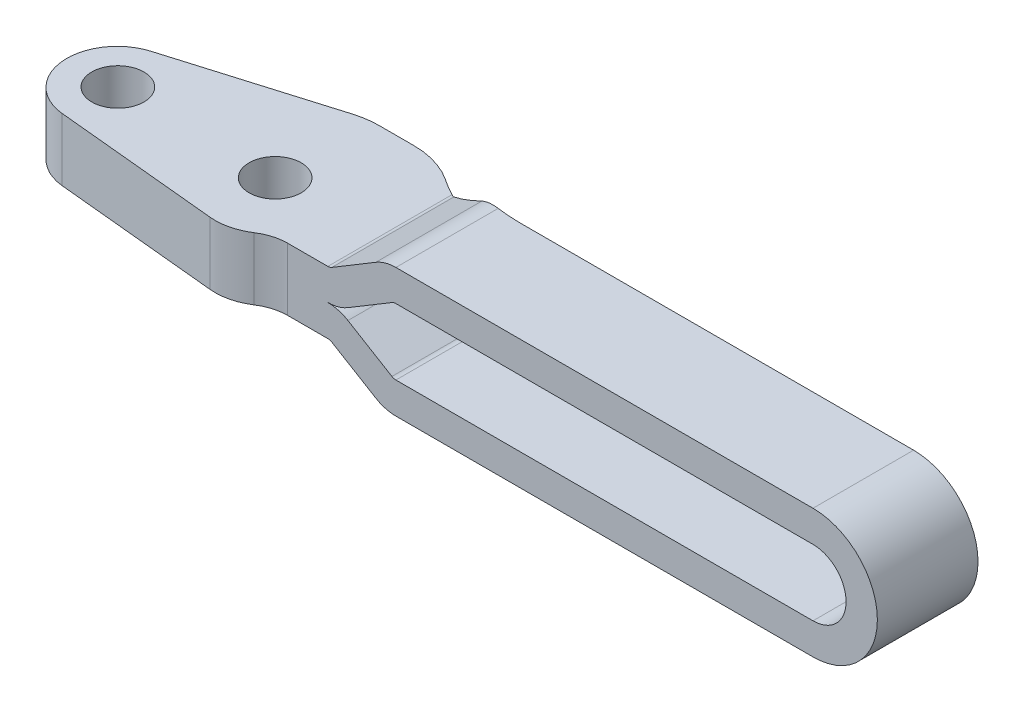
ISO-10303-21;
HEADER;
FILE_DESCRIPTION(('STEP AP214'),'2;1');
FILE_NAME('part.step','',(''),(''),'','','');
FILE_SCHEMA(('AUTOMOTIVE_DESIGN { 1 0 10303 214 1 1 1 1 }'));
ENDSEC;
DATA;
#1=APPLICATION_CONTEXT('core data for automotive mechanical design processes');
#2=APPLICATION_PROTOCOL_DEFINITION('international standard','automotive_design',2000,#1);
#3=PRODUCT_CONTEXT('',#1,'mechanical');
#4=PRODUCT('Part','Part','',(#3));
#5=PRODUCT_RELATED_PRODUCT_CATEGORY('part','',(#4));
#6=PRODUCT_DEFINITION_FORMATION('','',#4);
#7=PRODUCT_DEFINITION_CONTEXT('part definition',#1,'design');
#8=PRODUCT_DEFINITION('design','',#6,#7);
#9=PRODUCT_DEFINITION_SHAPE('','',#8);
#10=(LENGTH_UNIT() NAMED_UNIT(*) SI_UNIT(.MILLI.,.METRE.));
#11=(NAMED_UNIT(*) PLANE_ANGLE_UNIT() SI_UNIT($,.RADIAN.));
#12=(NAMED_UNIT(*) SI_UNIT($,.STERADIAN.) SOLID_ANGLE_UNIT());
#13=UNCERTAINTY_MEASURE_WITH_UNIT(LENGTH_MEASURE(1.E-05),#10,'distance_accuracy_value','');
#14=(GEOMETRIC_REPRESENTATION_CONTEXT(3) GLOBAL_UNCERTAINTY_ASSIGNED_CONTEXT((#13)) GLOBAL_UNIT_ASSIGNED_CONTEXT((#10,
#11,#12)) REPRESENTATION_CONTEXT('',''));
#15=CARTESIAN_POINT('',(0.,0.,0.));
#16=DIRECTION('',(0.,0.,1.));
#17=DIRECTION('',(1.,0.,0.));
#18=AXIS2_PLACEMENT_3D('',#15,#16,#17);
#19=CARTESIAN_POINT('',(31.498978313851,-3.17500000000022,-15.1675));
#20=DIRECTION('',(0.,-1.,0.));
#21=DIRECTION('',(1.,0.,0.));
#22=AXIS2_PLACEMENT_3D('',#19,#20,#21);
#23=PLANE('',#22);
#24=DIRECTION('',(-1.,0.,0.));
#25=VECTOR('',#24,1.);
#26=CARTESIAN_POINT('',(31.498978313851,-3.17500000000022,4.8325));
#27=LINE('',#26,#25);
#28=CARTESIAN_POINT('',(71.5031516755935,-3.17500000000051,4.8325));
#29=VERTEX_POINT('',#28);
#30=CARTESIAN_POINT('',(31.498978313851,-3.17500000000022,4.8325));
#31=VERTEX_POINT('',#30);
#32=EDGE_CURVE('E509',#29,#31,#27,.T.);
#33=ORIENTED_EDGE('',*,*,#32,.F.);
#34=DIRECTION('',(0.,0.,1.));
#35=VECTOR('',#34,1.);
#36=CARTESIAN_POINT('',(71.5031516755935,-3.17500000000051,-15.1675));
#37=LINE('',#36,#35);
#38=CARTESIAN_POINT('',(71.5031516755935,-3.17500000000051,-4.81950000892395));
#39=VERTEX_POINT('',#38);
#40=EDGE_CURVE('E476',#39,#29,#37,.T.);
#41=ORIENTED_EDGE('',*,*,#40,.F.);
#42=DIRECTION('',(1.,0.,0.));
#43=VECTOR('',#42,1.);
#44=CARTESIAN_POINT('',(31.498978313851,-3.17500000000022,-4.81950000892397));
#45=LINE('',#44,#43);
#46=CARTESIAN_POINT('',(33.9646617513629,-3.17500000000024,-4.81950000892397));
#47=VERTEX_POINT('',#46);
#48=EDGE_CURVE('E484',#47,#39,#45,.T.);
#49=ORIENTED_EDGE('',*,*,#48,.F.);
#50=CARTESIAN_POINT('',(33.9646617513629,-3.17500000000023,-23.8694999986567));
#51=DIRECTION('',(0.,-1.,0.));
#52=DIRECTION('',(1.,0.,0.));
#53=AXIS2_PLACEMENT_3D('',#50,#51,#52);
#54=CIRCLE('',#53,19.0499999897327);
#55=CARTESIAN_POINT('',(31.498978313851,-3.17500000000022,-4.97974338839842));
#56=VERTEX_POINT('',#55);
#57=EDGE_CURVE('E223',#56,#47,#54,.F.);
#58=ORIENTED_EDGE('',*,*,#57,.F.);
#59=DIRECTION('',(0.,0.,1.));
#60=VECTOR('',#59,1.);
#61=CARTESIAN_POINT('',(31.498978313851,-3.17500000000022,-15.1675));
#62=LINE('',#61,#60);
#63=EDGE_CURVE('E453',#56,#31,#62,.T.);
#64=ORIENTED_EDGE('',*,*,#63,.T.);
#65=EDGE_LOOP('',(#33,#41,#49,#58,#64));
#66=FACE_BOUND('',#65,.T.);
#67=ADVANCED_FACE('F14',(#66),#23,.F.);
#68=CARTESIAN_POINT('',(71.5031516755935,-5.10008701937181E-13,-15.1675));
#69=DIRECTION('',(0.,0.,1.));
#70=DIRECTION('',(1.,0.,0.));
#71=AXIS2_PLACEMENT_3D('',#68,#69,#70);
#72=CYLINDRICAL_SURFACE('',#71,3.175);
#73=CARTESIAN_POINT('',(71.5031516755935,-5.10008701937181E-13,4.8325));
#74=DIRECTION('',(0.,0.,1.));
#75=DIRECTION('',(1.,0.,0.));
#76=AXIS2_PLACEMENT_3D('',#73,#74,#75);
#77=CIRCLE('',#76,3.175);
#78=CARTESIAN_POINT('',(71.5031516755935,3.17499999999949,4.8325));
#79=VERTEX_POINT('',#78);
#80=EDGE_CURVE('E382',#79,#29,#77,.F.);
#81=ORIENTED_EDGE('',*,*,#80,.F.);
#82=DIRECTION('',(0.,0.,1.));
#83=VECTOR('',#82,1.);
#84=CARTESIAN_POINT('',(71.5031516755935,3.17499999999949,-15.1675));
#85=LINE('',#84,#83);
#86=CARTESIAN_POINT('',(71.5031516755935,3.17499999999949,-4.81950000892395));
#87=VERTEX_POINT('',#86);
#88=EDGE_CURVE('E473',#87,#79,#85,.T.);
#89=ORIENTED_EDGE('',*,*,#88,.F.);
#90=CARTESIAN_POINT('',(71.5031516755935,-5.10008701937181E-13,-4.81950000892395));
#91=DIRECTION('',(0.,0.,-1.));
#92=DIRECTION('',(-1.,0.,0.));
#93=AXIS2_PLACEMENT_3D('',#90,#91,#92);
#94=CIRCLE('',#93,3.175);
#95=EDGE_CURVE('E544',#39,#87,#94,.F.);
#96=ORIENTED_EDGE('',*,*,#95,.F.);
#97=ORIENTED_EDGE('',*,*,#40,.T.);
#98=EDGE_LOOP('',(#81,#89,#96,#97));
#99=FACE_BOUND('',#98,.T.);
#100=ADVANCED_FACE('F348',(#99),#72,.F.);
#101=CARTESIAN_POINT('',(71.5031516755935,3.17499999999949,-15.1675));
#102=DIRECTION('',(0.,1.,0.));
#103=DIRECTION('',(0.,0.,1.));
#104=AXIS2_PLACEMENT_3D('',#101,#102,#103);
#105=PLANE('',#104);
#106=DIRECTION('',(1.,0.,0.));
#107=VECTOR('',#106,1.);
#108=CARTESIAN_POINT('',(71.5031516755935,3.17499999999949,4.8325));
#109=LINE('',#108,#107);
#110=CARTESIAN_POINT('',(31.4989783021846,3.17499999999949,4.8325));
#111=VERTEX_POINT('',#110);
#112=EDGE_CURVE('E384',#111,#79,#109,.T.);
#113=ORIENTED_EDGE('',*,*,#112,.F.);
#114=DIRECTION('',(0.,0.,1.));
#115=VECTOR('',#114,1.);
#116=CARTESIAN_POINT('',(31.4989783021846,3.17499999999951,-15.1675));
#117=LINE('',#116,#115);
#118=CARTESIAN_POINT('',(31.4989783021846,3.17499999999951,-4.97974338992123));
#119=VERTEX_POINT('',#118);
#120=EDGE_CURVE('E470',#119,#111,#117,.T.);
#121=ORIENTED_EDGE('',*,*,#120,.F.);
#122=CARTESIAN_POINT('',(33.9646617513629,3.17499999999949,-23.8694999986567));
#123=DIRECTION('',(0.,1.,0.));
#124=DIRECTION('',(0.,0.,1.));
#125=AXIS2_PLACEMENT_3D('',#122,#123,#124);
#126=CIRCLE('',#125,19.0499999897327);
#127=CARTESIAN_POINT('',(33.9646617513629,3.17499999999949,-4.81950000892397));
#128=VERTEX_POINT('',#127);
#129=EDGE_CURVE('E580',#128,#119,#126,.F.);
#130=ORIENTED_EDGE('',*,*,#129,.F.);
#131=DIRECTION('',(-1.,0.,0.));
#132=VECTOR('',#131,1.);
#133=CARTESIAN_POINT('',(71.5031516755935,3.17499999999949,-4.81950000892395));
#134=LINE('',#133,#132);
#135=EDGE_CURVE('E217',#87,#128,#134,.T.);
#136=ORIENTED_EDGE('',*,*,#135,.F.);
#137=ORIENTED_EDGE('',*,*,#88,.T.);
#138=EDGE_LOOP('',(#113,#121,#130,#136,#137));
#139=FACE_BOUND('',#138,.T.);
#140=ADVANCED_FACE('F355',(#139),#105,.F.);
#141=CARTESIAN_POINT('',(31.4989783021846,2.43499999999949,-15.1675));
#142=DIRECTION('',(0.,0.,1.));
#143=DIRECTION('',(1.,0.,0.));
#144=AXIS2_PLACEMENT_3D('',#141,#142,#143);
#145=CYLINDRICAL_SURFACE('',#144,0.740000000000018);
#146=CARTESIAN_POINT('',(31.4989783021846,2.43499999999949,4.8325));
#147=DIRECTION('',(0.,0.,1.));
#148=DIRECTION('',(1.,0.,0.));
#149=AXIS2_PLACEMENT_3D('',#146,#147,#148);
#150=CIRCLE('',#149,0.740000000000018);
#151=CARTESIAN_POINT('',(31.1178501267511,3.06930380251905,4.8325));
#152=VERTEX_POINT('',#151);
#153=EDGE_CURVE('E386',#152,#111,#150,.F.);
#154=ORIENTED_EDGE('',*,*,#153,.F.);
#155=DIRECTION('',(0.,0.,1.));
#156=VECTOR('',#155,1.);
#157=CARTESIAN_POINT('',(31.1178501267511,3.06930380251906,-15.1675));
#158=LINE('',#157,#156);
#159=CARTESIAN_POINT('',(31.1178501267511,3.06930380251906,-5.03341327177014));
#160=VERTEX_POINT('',#159);
#161=EDGE_CURVE('E467',#160,#152,#158,.T.);
#162=ORIENTED_EDGE('',*,*,#161,.F.);
#163=CARTESIAN_POINT('',(31.4989783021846,3.17499999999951,-4.97974338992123));
#164=CARTESIAN_POINT('',(31.4565310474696,3.17504192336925,-4.985278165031));
#165=CARTESIAN_POINT('',(31.4140902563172,3.17135035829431,-4.99096923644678));
#166=CARTESIAN_POINT('',(31.3313936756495,3.15695659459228,-5.00233154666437));
#167=CARTESIAN_POINT('',(31.2911103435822,3.14641073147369,-5.00800045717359));
#168=CARTESIAN_POINT('',(31.2288267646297,3.12436674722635,-5.01695996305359));
#169=CARTESIAN_POINT('',(31.2060559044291,3.1150016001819,-5.02027983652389));
#170=CARTESIAN_POINT('',(31.1612525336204,3.09390951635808,-5.02689098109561));
#171=CARTESIAN_POINT('',(31.1392339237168,3.0821527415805,-5.03018127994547));
#172=CARTESIAN_POINT('',(31.1178501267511,3.06930380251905,-5.03341327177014));
#173=B_SPLINE_CURVE_WITH_KNOTS('',3,(#163,#164,#165,#166,#167,#168,#169,#170,#171,#172),
.UNSPECIFIED.,.F.,.F.,(4,2,2,2,4),(0.,0.128294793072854,0.253761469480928,0.32818303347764,
0.403597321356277),.UNSPECIFIED.);
#174=EDGE_CURVE('E301',#119,#160,#173,.T.);
#175=ORIENTED_EDGE('',*,*,#174,.F.);
#176=ORIENTED_EDGE('',*,*,#120,.T.);
#177=EDGE_LOOP('',(#154,#162,#175,#176));
#178=FACE_BOUND('',#177,.T.);
#179=ADVANCED_FACE('F643',(#178),#145,.F.);
#180=CARTESIAN_POINT('',(31.1178501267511,3.06930380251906,-15.1675));
#181=DIRECTION('',(-0.515038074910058,0.85716730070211,0.));
#182=DIRECTION('',(-0.85716730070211,-0.515038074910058,0.));
#183=AXIS2_PLACEMENT_3D('',#180,#181,#182);
#184=PLANE('',#183);
#185=DIRECTION('',(0.85716730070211,0.515038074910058,0.));
#186=VECTOR('',#185,1.);
#187=CARTESIAN_POINT('',(31.1178501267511,3.06930380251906,4.8325));
#188=LINE('',#187,#186);
#189=CARTESIAN_POINT('',(26.8987193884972,0.534194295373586,4.8325));
#190=VERTEX_POINT('',#189);
#191=EDGE_CURVE('E388',#190,#152,#188,.T.);
#192=ORIENTED_EDGE('',*,*,#191,.F.);
#193=DIRECTION('',(0.,0.,1.));
#194=VECTOR('',#193,1.);
#195=CARTESIAN_POINT('',(26.8987193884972,0.534194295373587,-15.1675));
#196=LINE('',#195,#194);
#197=CARTESIAN_POINT('',(26.8987193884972,0.534194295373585,-6.17840172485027));
#198=VERTEX_POINT('',#197);
#199=EDGE_CURVE('E464',#198,#190,#196,.T.);
#200=ORIENTED_EDGE('',*,*,#199,.F.);
#201=CARTESIAN_POINT('',(33.9646617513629,4.77984079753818,-23.8694999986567));
#202=DIRECTION('',(-0.515038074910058,0.85716730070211,0.));
#203=DIRECTION('',(0.85716730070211,0.515038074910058,0.));
#204=AXIS2_PLACEMENT_3D('',#201,#202,#203);
#205=ELLIPSE('',#204,22.224366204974,19.0499999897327);
#206=EDGE_CURVE('E577',#160,#198,#205,.F.);
#207=ORIENTED_EDGE('',*,*,#206,.F.);
#208=ORIENTED_EDGE('',*,*,#161,.T.);
#209=EDGE_LOOP('',(#192,#200,#207,#208));
#210=FACE_BOUND('',#209,.T.);
#211=ADVANCED_FACE('F639',(#210),#184,.F.);
#212=CARTESIAN_POINT('',(24.9724769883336,3.73999999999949,-15.1675));
#213=DIRECTION('',(0.,0.,1.));
#214=DIRECTION('',(1.,0.,0.));
#215=AXIS2_PLACEMENT_3D('',#212,#213,#214);
#216=CYLINDRICAL_SURFACE('',#215,3.74);
#217=CARTESIAN_POINT('',(24.9724769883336,3.73999999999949,4.8325));
#218=DIRECTION('',(0.,0.,1.));
#219=DIRECTION('',(1.,0.,0.));
#220=AXIS2_PLACEMENT_3D('',#217,#218,#219);
#221=CIRCLE('',#220,3.74);
#222=CARTESIAN_POINT('',(24.9724769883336,-5.09575021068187E-13,4.8325));
#223=VERTEX_POINT('',#222);
#224=EDGE_CURVE('E390',#223,#190,#221,.T.);
#225=ORIENTED_EDGE('',*,*,#224,.F.);
#226=DIRECTION('',(0.,0.,1.));
#227=VECTOR('',#226,1.);
#228=CARTESIAN_POINT('',(24.9724769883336,-3.1788807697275E-13,-15.1675));
#229=LINE('',#228,#227);
#230=CARTESIAN_POINT('',(24.9724769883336,-3.1788807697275E-13,-7.07536075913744));
#231=VERTEX_POINT('',#230);
#232=EDGE_CURVE('E461',#231,#223,#229,.T.);
#233=ORIENTED_EDGE('',*,*,#232,.F.);
#234=CARTESIAN_POINT('',(26.8987193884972,0.534194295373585,-6.17840172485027));
#235=CARTESIAN_POINT('',(26.8015997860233,0.475820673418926,-6.2171807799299));
#236=CARTESIAN_POINT('',(26.7023646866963,0.422218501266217,-6.25775374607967));
#237=CARTESIAN_POINT('',(26.5006929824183,0.324642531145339,-6.34227795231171));
#238=CARTESIAN_POINT('',(26.3982574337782,0.280665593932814,-6.38622808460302));
#239=CARTESIAN_POINT('',(26.1932963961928,0.203198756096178,-6.47637840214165));
#240=CARTESIAN_POINT('',(26.0908167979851,0.169510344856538,-6.52251305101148));
#241=CARTESIAN_POINT('',(25.8845972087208,0.111348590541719,-6.61760300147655));
#242=CARTESIAN_POINT('',(25.7808574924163,0.0868732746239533,-6.66655769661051));
#243=CARTESIAN_POINT('',(25.5601194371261,0.0445426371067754,-6.77321566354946));
#244=CARTESIAN_POINT('',(25.443057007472,0.0278690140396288,-6.83125511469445));
#245=CARTESIAN_POINT('',(25.207915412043,0.00552501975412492,-6.95088123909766));
#246=CARTESIAN_POINT('',(25.089840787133,-1.16478236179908E-05,-7.01250198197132));
#247=CARTESIAN_POINT('',(24.9724769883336,-8.14785318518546E-13,-7.07536075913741));
#248=B_SPLINE_CURVE_WITH_KNOTS('',3,(#234,#235,#236,#237,#238,#239,#240,#241,#242,#243,#244,
#245,#246,#247),.UNSPECIFIED.,.F.,.F.,(4,2,2,2,2,2,4),(0.,0.359125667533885,0.718134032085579,
1.06969962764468,1.42118989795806,1.81583425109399,2.21518884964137),.UNSPECIFIED.);
#249=EDGE_CURVE('E292',#198,#231,#248,.T.);
#250=ORIENTED_EDGE('',*,*,#249,.F.);
#251=ORIENTED_EDGE('',*,*,#199,.T.);
#252=EDGE_LOOP('',(#225,#233,#250,#251));
#253=FACE_BOUND('',#252,.T.);
#254=ADVANCED_FACE('F636',(#253),#216,.T.);
#255=CARTESIAN_POINT('',(24.972477,-3.74000000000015,-15.1675));
#256=DIRECTION('',(0.,0.,1.));
#257=DIRECTION('',(1.,0.,0.));
#258=AXIS2_PLACEMENT_3D('',#255,#256,#257);
#259=CYLINDRICAL_SURFACE('',#258,3.73999999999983);
#260=CARTESIAN_POINT('',(24.972477,-3.74000000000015,4.8325));
#261=DIRECTION('',(0.,0.,1.));
#262=DIRECTION('',(1.,0.,0.));
#263=AXIS2_PLACEMENT_3D('',#260,#261,#262);
#264=CIRCLE('',#263,3.73999999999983);
#265=CARTESIAN_POINT('',(26.8987194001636,-0.534194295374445,4.8325));
#266=VERTEX_POINT('',#265);
#267=EDGE_CURVE('E392',#266,#223,#264,.T.);
#268=ORIENTED_EDGE('',*,*,#267,.F.);
#269=DIRECTION('',(0.,0.,1.));
#270=VECTOR('',#269,1.);
#271=CARTESIAN_POINT('',(26.8987194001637,-0.53419429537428,-15.1675));
#272=LINE('',#271,#270);
#273=CARTESIAN_POINT('',(26.8987194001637,-0.53419429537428,-6.17840172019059));
#274=VERTEX_POINT('',#273);
#275=EDGE_CURVE('E458',#274,#266,#272,.T.);
#276=ORIENTED_EDGE('',*,*,#275,.F.);
#277=CARTESIAN_POINT('',(24.9724769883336,-3.1788807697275E-13,-7.07536075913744));
#278=CARTESIAN_POINT('',(25.0803589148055,7.23943557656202E-06,-7.01758431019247));
#279=CARTESIAN_POINT('',(25.1888312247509,-0.00466833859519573,-6.96085422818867));
#280=CARTESIAN_POINT('',(25.4062727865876,-0.0236402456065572,-6.84976778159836));
#281=CARTESIAN_POINT('',(25.5152424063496,-0.0379455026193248,-6.79541366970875));
#282=CARTESIAN_POINT('',(25.7303833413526,-0.0760067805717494,-6.69064143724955));
#283=CARTESIAN_POINT('',(25.8365631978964,-0.0995465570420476,-6.64016281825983));
#284=CARTESIAN_POINT('',(26.0476416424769,-0.156209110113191,-6.54215670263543));
#285=CARTESIAN_POINT('',(26.1525409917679,-0.189325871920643,-6.49462737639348));
#286=CARTESIAN_POINT('',(26.3659655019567,-0.267337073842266,-6.40019444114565));
#287=CARTESIAN_POINT('',(26.4743704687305,-0.312781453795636,-6.35347071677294));
#288=CARTESIAN_POINT('',(26.6889214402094,-0.414981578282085,-6.26325266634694));
#289=CARTESIAN_POINT('',(26.7950253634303,-0.471865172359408,-6.21980325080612));
#290=CARTESIAN_POINT('',(26.8987194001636,-0.534194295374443,-6.17840172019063));
#291=B_SPLINE_CURVE_WITH_KNOTS('',3,(#277,#278,#279,#280,#281,#282,#283,#284,#285,#286,#287,
#288,#289,#290),.UNSPECIFIED.,.F.,.F.,(4,2,2,2,2,2,4),(0.,0.367082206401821,0.73450521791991,
1.09379376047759,1.45285714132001,1.83177266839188,2.21518542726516),.UNSPECIFIED.);
#292=EDGE_CURVE('E284',#231,#274,#291,.T.);
#293=ORIENTED_EDGE('',*,*,#292,.F.);
#294=ORIENTED_EDGE('',*,*,#232,.T.);
#295=EDGE_LOOP('',(#268,#276,#293,#294));
#296=FACE_BOUND('',#295,.T.);
#297=ADVANCED_FACE('F631',(#296),#259,.T.);
#298=CARTESIAN_POINT('',(26.8987194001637,-0.53419429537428,-15.1675));
#299=DIRECTION('',(-0.515038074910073,-0.857167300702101,0.));
#300=DIRECTION('',(0.857167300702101,-0.515038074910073,0.));
#301=AXIS2_PLACEMENT_3D('',#298,#299,#300);
#302=PLANE('',#301);
#303=DIRECTION('',(-0.857167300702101,0.515038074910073,0.));
#304=VECTOR('',#303,1.);
#305=CARTESIAN_POINT('',(26.8987194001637,-0.53419429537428,4.8325));
#306=LINE('',#305,#304);
#307=CARTESIAN_POINT('',(31.1178501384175,-3.06930380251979,4.8325));
#308=VERTEX_POINT('',#307);
#309=EDGE_CURVE('E394',#308,#266,#306,.T.);
#310=ORIENTED_EDGE('',*,*,#309,.F.);
#311=DIRECTION('',(0.,0.,1.));
#312=VECTOR('',#311,1.);
#313=CARTESIAN_POINT('',(31.1178501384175,-3.06930380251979,-15.1675));
#314=LINE('',#313,#312);
#315=CARTESIAN_POINT('',(31.1178501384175,-3.0693038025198,-5.03341327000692));
#316=VERTEX_POINT('',#315);
#317=EDGE_CURVE('E454',#316,#308,#314,.T.);
#318=ORIENTED_EDGE('',*,*,#317,.F.);
#319=CARTESIAN_POINT('',(33.9646617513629,-4.7798407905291,-23.8694999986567));
#320=DIRECTION('',(-0.515038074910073,-0.857167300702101,0.));
#321=DIRECTION('',(-0.857167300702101,0.515038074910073,0.));
#322=AXIS2_PLACEMENT_3D('',#319,#320,#321);
#323=ELLIPSE('',#322,22.2243662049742,19.0499999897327);
#324=EDGE_CURVE('E573',#274,#316,#323,.F.);
#325=ORIENTED_EDGE('',*,*,#324,.F.);
#326=ORIENTED_EDGE('',*,*,#275,.T.);
#327=EDGE_LOOP('',(#310,#318,#325,#326));
#328=FACE_BOUND('',#327,.T.);
#329=ADVANCED_FACE('F364',(#328),#302,.F.);
#330=CARTESIAN_POINT('',(31.4989783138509,-2.43500000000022,-15.1675));
#331=DIRECTION('',(0.,0.,1.));
#332=DIRECTION('',(1.,0.,0.));
#333=AXIS2_PLACEMENT_3D('',#330,#331,#332);
#334=CYLINDRICAL_SURFACE('',#333,0.74);
#335=CARTESIAN_POINT('',(31.4989783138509,-2.43500000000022,4.8325));
#336=DIRECTION('',(0.,0.,1.));
#337=DIRECTION('',(1.,0.,0.));
#338=AXIS2_PLACEMENT_3D('',#335,#336,#337);
#339=CIRCLE('',#338,0.74);
#340=EDGE_CURVE('E396',#31,#308,#339,.F.);
#341=ORIENTED_EDGE('',*,*,#340,.F.);
#342=ORIENTED_EDGE('',*,*,#63,.F.);
#343=CARTESIAN_POINT('',(31.1178501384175,-3.0693038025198,-5.03341327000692));
#344=CARTESIAN_POINT('',(31.1542167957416,-3.09120372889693,-5.02791197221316));
#345=CARTESIAN_POINT('',(31.1924990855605,-3.10989872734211,-5.02223852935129));
#346=CARTESIAN_POINT('',(31.2707992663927,-3.1401527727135,-5.01089228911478));
#347=CARTESIAN_POINT('',(31.3107602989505,-3.15186003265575,-5.00522223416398));
#348=CARTESIAN_POINT('',(31.3755004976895,-3.16504215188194,-4.99625586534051));
#349=CARTESIAN_POINT('',(31.3998419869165,-3.16874218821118,-4.99293231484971));
#350=CARTESIAN_POINT('',(31.4491070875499,-3.17373763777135,-4.98630345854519));
#351=CARTESIAN_POINT('',(31.4740341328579,-3.17500031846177,-4.98299898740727));
#352=CARTESIAN_POINT('',(31.498978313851,-3.17500000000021,-4.97974338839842));
#353=B_SPLINE_CURVE_WITH_KNOTS('',3,(#343,#344,#345,#346,#347,#348,#349,#350,#351,#352),
.UNSPECIFIED.,.F.,.F.,(4,2,2,2,4),(0.,0.128294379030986,0.253760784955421,0.328182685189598,
0.403597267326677),.UNSPECIFIED.);
#354=EDGE_CURVE('E273',#316,#56,#353,.T.);
#355=ORIENTED_EDGE('',*,*,#354,.F.);
#356=ORIENTED_EDGE('',*,*,#317,.T.);
#357=EDGE_LOOP('',(#341,#342,#355,#356));
#358=FACE_BOUND('',#357,.T.);
#359=ADVANCED_FACE('F360',(#358),#334,.F.);
#360=CARTESIAN_POINT('',(77.6781516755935,-12.5,4.8325));
#361=DIRECTION('',(0.,0.,1.));
#362=DIRECTION('',(1.,0.,0.));
#363=AXIS2_PLACEMENT_3D('',#360,#361,#362);
#364=PLANE('',#363);
#365=DIRECTION('',(0.,1.,0.));
#366=VECTOR('',#365,1.);
#367=CARTESIAN_POINT('',(21.1267910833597,-12.5,4.8325));
#368=LINE('',#367,#366);
#369=CARTESIAN_POINT('',(21.1267910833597,-3.00000000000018,4.8325));
#370=VERTEX_POINT('',#369);
#371=CARTESIAN_POINT('',(21.1267910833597,2.99999999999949,4.8325));
#372=VERTEX_POINT('',#371);
#373=EDGE_CURVE('E542',#370,#372,#368,.T.);
#374=ORIENTED_EDGE('',*,*,#373,.F.);
#375=DIRECTION('',(-1.,0.,0.));
#376=VECTOR('',#375,1.);
#377=CARTESIAN_POINT('',(-5.17065825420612,-3.,4.8325));
#378=LINE('',#377,#376);
#379=CARTESIAN_POINT('',(24.972477,-3.00000000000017,4.8325));
#380=VERTEX_POINT('',#379);
#381=EDGE_CURVE('E398',#380,#370,#378,.T.);
#382=ORIENTED_EDGE('',*,*,#381,.F.);
#383=CARTESIAN_POINT('',(24.972477,-3.74000000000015,4.8325));
#384=DIRECTION('',(0.,0.,1.));
#385=DIRECTION('',(1.,0.,0.));
#386=AXIS2_PLACEMENT_3D('',#383,#384,#385);
#387=CIRCLE('',#386,0.74);
#388=CARTESIAN_POINT('',(25.3536051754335,-3.10569619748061,4.8325));
#389=VERTEX_POINT('',#388);
#390=EDGE_CURVE('E401',#389,#380,#387,.T.);
#391=ORIENTED_EDGE('',*,*,#390,.F.);
#392=DIRECTION('',(-0.857167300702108,0.515038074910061,0.));
#393=VECTOR('',#392,1.);
#394=CARTESIAN_POINT('',(25.3536051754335,-3.1056961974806,4.8325));
#395=LINE('',#394,#393);
#396=CARTESIAN_POINT('',(29.5727359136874,-5.64080570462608,4.8325));
#397=VERTEX_POINT('',#396);
#398=EDGE_CURVE('E404',#397,#389,#395,.T.);
#399=ORIENTED_EDGE('',*,*,#398,.F.);
#400=CARTESIAN_POINT('',(31.4989783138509,-2.43500000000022,4.8325));
#401=DIRECTION('',(0.,0.,1.));
#402=DIRECTION('',(1.,0.,0.));
#403=AXIS2_PLACEMENT_3D('',#400,#401,#402);
#404=CIRCLE('',#403,3.73999999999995);
#405=CARTESIAN_POINT('',(31.498978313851,-6.17500000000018,4.8325));
#406=VERTEX_POINT('',#405);
#407=EDGE_CURVE('E407',#406,#397,#404,.F.);
#408=ORIENTED_EDGE('',*,*,#407,.F.);
#409=DIRECTION('',(-1.,0.,0.));
#410=VECTOR('',#409,1.);
#411=CARTESIAN_POINT('',(31.498978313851,-6.17500000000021,4.8325));
#412=LINE('',#411,#410);
#413=CARTESIAN_POINT('',(71.5031516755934,-6.17500000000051,4.8325));
#414=VERTEX_POINT('',#413);
#415=EDGE_CURVE('E410',#414,#406,#412,.T.);
#416=ORIENTED_EDGE('',*,*,#415,.F.);
#417=CARTESIAN_POINT('',(71.5031516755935,-5.10008701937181E-13,4.8325));
#418=DIRECTION('',(0.,0.,1.));
#419=DIRECTION('',(1.,0.,0.));
#420=AXIS2_PLACEMENT_3D('',#417,#418,#419);
#421=CIRCLE('',#420,6.175);
#422=CARTESIAN_POINT('',(71.5031516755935,6.17499999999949,4.8325));
#423=VERTEX_POINT('',#422);
#424=EDGE_CURVE('E412',#423,#414,#421,.F.);
#425=ORIENTED_EDGE('',*,*,#424,.F.);
#426=DIRECTION('',(1.,0.,0.));
#427=VECTOR('',#426,1.);
#428=CARTESIAN_POINT('',(71.5031516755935,6.17499999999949,4.8325));
#429=LINE('',#428,#427);
#430=CARTESIAN_POINT('',(31.4989783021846,6.17499999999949,4.8325));
#431=VERTEX_POINT('',#430);
#432=EDGE_CURVE('E414',#431,#423,#429,.T.);
#433=ORIENTED_EDGE('',*,*,#432,.F.);
#434=CARTESIAN_POINT('',(31.4989783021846,2.43499999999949,4.8325));
#435=DIRECTION('',(0.,0.,1.));
#436=DIRECTION('',(1.,0.,0.));
#437=AXIS2_PLACEMENT_3D('',#434,#435,#436);
#438=CIRCLE('',#437,3.74);
#439=CARTESIAN_POINT('',(29.5727359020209,5.64080570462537,4.8325));
#440=VERTEX_POINT('',#439);
#441=EDGE_CURVE('E417',#440,#431,#438,.F.);
#442=ORIENTED_EDGE('',*,*,#441,.F.);
#443=DIRECTION('',(0.857167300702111,0.515038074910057,0.));
#444=VECTOR('',#443,1.);
#445=CARTESIAN_POINT('',(29.5727359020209,5.64080570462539,4.8325));
#446=LINE('',#445,#444);
#447=CARTESIAN_POINT('',(25.353605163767,3.10569619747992,4.8325));
#448=VERTEX_POINT('',#447);
#449=EDGE_CURVE('E420',#448,#440,#446,.T.);
#450=ORIENTED_EDGE('',*,*,#449,.F.);
#451=CARTESIAN_POINT('',(24.9724769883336,3.73999999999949,4.8325));
#452=DIRECTION('',(0.,0.,1.));
#453=DIRECTION('',(1.,0.,0.));
#454=AXIS2_PLACEMENT_3D('',#451,#452,#453);
#455=CIRCLE('',#454,0.73999999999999);
#456=CARTESIAN_POINT('',(24.9724769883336,2.9999999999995,4.8325));
#457=VERTEX_POINT('',#456);
#458=EDGE_CURVE('E423',#457,#448,#455,.T.);
#459=ORIENTED_EDGE('',*,*,#458,.F.);
#460=DIRECTION('',(1.,0.,0.));
#461=VECTOR('',#460,1.);
#462=CARTESIAN_POINT('',(24.9724769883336,2.99999999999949,4.8325));
#463=LINE('',#462,#461);
#464=EDGE_CURVE('E426',#372,#457,#463,.T.);
#465=ORIENTED_EDGE('',*,*,#464,.F.);
#466=EDGE_LOOP('',(#374,#382,#391,#399,#408,#416,#425,#433,#442,#450,#459,#465));
#467=FACE_BOUND('',#466,.T.);
#468=ORIENTED_EDGE('',*,*,#340,.T.);
#469=ORIENTED_EDGE('',*,*,#309,.T.);
#470=ORIENTED_EDGE('',*,*,#267,.T.);
#471=ORIENTED_EDGE('',*,*,#224,.T.);
#472=ORIENTED_EDGE('',*,*,#191,.T.);
#473=ORIENTED_EDGE('',*,*,#153,.T.);
#474=ORIENTED_EDGE('',*,*,#112,.T.);
#475=ORIENTED_EDGE('',*,*,#80,.T.);
#476=ORIENTED_EDGE('',*,*,#32,.T.);
#477=EDGE_LOOP('',(#468,#469,#470,#471,#472,#473,#474,#475,#476));
#478=FACE_BOUND('',#477,.T.);
#479=ADVANCED_FACE('F266',(#467,#478),#364,.T.);
#480=CARTESIAN_POINT('',(33.9646617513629,-12.5,-23.8694999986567));
#481=DIRECTION('',(0.,1.,0.));
#482=DIRECTION('',(0.,0.,1.));
#483=AXIS2_PLACEMENT_3D('',#480,#481,#482);
#484=CYLINDRICAL_SURFACE('',#483,19.0499999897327);
#485=CARTESIAN_POINT('',(25.353605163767,3.10569619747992,-6.87678967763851));
#486=CARTESIAN_POINT('',(25.3133546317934,3.08148637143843,-6.8971775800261));
#487=CARTESIAN_POINT('',(25.2712511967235,3.06142340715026,-6.91870168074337));
#488=CARTESIAN_POINT('',(25.1856406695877,3.02993666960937,-6.96288944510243));
#489=CARTESIAN_POINT('',(25.1421777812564,3.01834994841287,-6.98552216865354));
#490=CARTESIAN_POINT('',(25.0775512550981,3.00719352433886,-7.01950508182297));
#491=CARTESIAN_POINT('',(25.05670058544,3.00450877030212,-7.0305187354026));
#492=CARTESIAN_POINT('',(25.0147219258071,3.00090460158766,-7.05279272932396));
#493=CARTESIAN_POINT('',(24.9935931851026,3.00000223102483,-7.06405441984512));
#494=CARTESIAN_POINT('',(24.9724769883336,2.9999999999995,-7.07536075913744));
#495=B_SPLINE_CURVE_WITH_KNOTS('',3,(#485,#486,#487,#488,#489,#490,#491,#492,#493,#494),
.UNSPECIFIED.,.F.,.F.,(4,2,2,2,4),(0.,0.15335531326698,0.303678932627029,0.374821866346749,
0.446641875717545),.UNSPECIFIED.);
#496=CARTESIAN_POINT('',(25.353605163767,3.10569619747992,-6.87678967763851));
#497=VERTEX_POINT('',#496);
#498=CARTESIAN_POINT('',(24.9724769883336,2.9999999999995,-7.07536075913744));
#499=VERTEX_POINT('',#498);
#500=EDGE_CURVE('E372',#497,#499,#495,.T.);
#501=ORIENTED_EDGE('',*,*,#500,.F.);
#502=CARTESIAN_POINT('',(33.9646617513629,8.27974098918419,-23.8694999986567));
#503=DIRECTION('',(-0.515038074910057,0.857167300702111,0.));
#504=DIRECTION('',(0.857167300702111,0.515038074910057,0.));
#505=AXIS2_PLACEMENT_3D('',#502,#503,#504);
#506=ELLIPSE('',#505,22.224366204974,19.0499999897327);
#507=CARTESIAN_POINT('',(29.5727359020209,5.64080570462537,-5.33268562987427));
#508=VERTEX_POINT('',#507);
#509=EDGE_CURVE('E256',#508,#497,#506,.F.);
#510=ORIENTED_EDGE('',*,*,#509,.F.);
#511=CARTESIAN_POINT('',(31.4989783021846,6.17499999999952,-4.97974338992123));
#512=CARTESIAN_POINT('',(31.3913523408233,6.17501211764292,-4.99378232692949));
#513=CARTESIAN_POINT('',(31.2838568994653,6.1703548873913,-5.00875838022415));
#514=CARTESIAN_POINT('',(31.0699026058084,6.15185351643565,-5.0404142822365));
#515=CARTESIAN_POINT('',(30.9634438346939,6.13800866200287,-5.05709426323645));
#516=CARTESIAN_POINT('',(30.7546741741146,6.10168729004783,-5.0916020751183));
#517=CARTESIAN_POINT('',(30.6523235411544,6.07940709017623,-5.10939663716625));
#518=CARTESIAN_POINT('',(30.4500949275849,6.0264297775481,-5.14622883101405));
#519=CARTESIAN_POINT('',(30.3502161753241,5.99573532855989,-5.16526606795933));
#520=CARTESIAN_POINT('',(30.1342976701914,5.91936353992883,-5.20817251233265));
#521=CARTESIAN_POINT('',(30.018918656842,5.87192982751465,-5.23225843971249));
#522=CARTESIAN_POINT('',(29.7921044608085,5.76518615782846,-5.28170692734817));
#523=CARTESIAN_POINT('',(29.6807431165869,5.70572516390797,-5.30708229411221));
#524=CARTESIAN_POINT('',(29.5727359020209,5.64080570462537,-5.33268562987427));
#525=B_SPLINE_CURVE_WITH_KNOTS('',3,(#511,#512,#513,#514,#515,#516,#517,#518,#519,#520,#521,
#522,#523,#524),.UNSPECIFIED.,.F.,.F.,(4,2,2,2,2,2,4),(0.,0.325497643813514,0.651020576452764,
0.96939186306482,1.28766247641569,1.66819424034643,2.0538399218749),.UNSPECIFIED.);
#526=CARTESIAN_POINT('',(31.4989783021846,6.17499999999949,-4.97974338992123));
#527=VERTEX_POINT('',#526);
#528=EDGE_CURVE('E237',#527,#508,#525,.T.);
#529=ORIENTED_EDGE('',*,*,#528,.F.);
#530=CARTESIAN_POINT('',(33.9646617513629,6.17499999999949,-23.8694999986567));
#531=DIRECTION('',(0.,1.,0.));
#532=DIRECTION('',(0.,0.,1.));
#533=AXIS2_PLACEMENT_3D('',#530,#531,#532);
#534=CIRCLE('',#533,19.0499999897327);
#535=CARTESIAN_POINT('',(33.9646617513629,6.17499999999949,-4.81950000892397));
#536=VERTEX_POINT('',#535);
#537=EDGE_CURVE('E233',#536,#527,#534,.F.);
#538=ORIENTED_EDGE('',*,*,#537,.F.);
#539=DIRECTION('',(0.,1.,0.));
#540=VECTOR('',#539,1.);
#541=CARTESIAN_POINT('',(33.9646617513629,-12.5,-4.81950000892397));
#542=LINE('',#541,#540);
#543=EDGE_CURVE('E226',#128,#536,#542,.T.);
#544=ORIENTED_EDGE('',*,*,#543,.F.);
#545=ORIENTED_EDGE('',*,*,#129,.T.);
#546=ORIENTED_EDGE('',*,*,#174,.T.);
#547=ORIENTED_EDGE('',*,*,#206,.T.);
#548=ORIENTED_EDGE('',*,*,#249,.T.);
#549=ORIENTED_EDGE('',*,*,#292,.T.);
#550=ORIENTED_EDGE('',*,*,#324,.T.);
#551=ORIENTED_EDGE('',*,*,#354,.T.);
#552=ORIENTED_EDGE('',*,*,#57,.T.);
#553=CARTESIAN_POINT('',(33.9646617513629,-6.17500000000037,-4.81950000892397));
#554=VERTEX_POINT('',#553);
#555=EDGE_CURVE('E37',#554,#47,#542,.T.);
#556=ORIENTED_EDGE('',*,*,#555,.F.);
#557=CARTESIAN_POINT('',(33.9646617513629,-6.17500000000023,-23.8694999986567));
#558=DIRECTION('',(0.,-1.,0.));
#559=DIRECTION('',(1.,0.,0.));
#560=AXIS2_PLACEMENT_3D('',#557,#558,#559);
#561=CIRCLE('',#560,19.0499999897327);
#562=CARTESIAN_POINT('',(31.498978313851,-6.17500000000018,-4.97974338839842));
#563=VERTEX_POINT('',#562);
#564=EDGE_CURVE('E220',#563,#554,#561,.F.);
#565=ORIENTED_EDGE('',*,*,#564,.F.);
#566=CARTESIAN_POINT('',(29.5727359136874,-5.64080570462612,-5.33268562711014));
#567=CARTESIAN_POINT('',(29.6639092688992,-5.69559786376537,-5.3110777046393));
#568=CARTESIAN_POINT('',(29.7574588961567,-5.74650448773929,-5.28962936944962));
#569=CARTESIAN_POINT('',(29.9487079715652,-5.84022985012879,-5.24735867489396));
#570=CARTESIAN_POINT('',(30.0464090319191,-5.88304541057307,-5.22653656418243));
#571=CARTESIAN_POINT('',(30.2430774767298,-5.9593713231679,-5.18629441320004));
#572=CARTESIAN_POINT('',(30.3419685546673,-5.99306720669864,-5.1668535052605));
#573=CARTESIAN_POINT('',(30.5423834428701,-6.0521035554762,-5.1291448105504));
#574=CARTESIAN_POINT('',(30.6439061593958,-6.0774474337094,-5.11087654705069));
#575=CARTESIAN_POINT('',(30.8689647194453,-6.12367328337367,-5.07230464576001));
#576=CARTESIAN_POINT('',(30.9929331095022,-6.14272179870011,-5.05229864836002));
#577=CARTESIAN_POINT('',(31.244185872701,-6.16848310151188,-5.01431339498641));
#578=CARTESIAN_POINT('',(31.3714924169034,-6.17502536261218,-4.99636525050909));
#579=CARTESIAN_POINT('',(31.498978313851,-6.17500000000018,-4.97974338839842));
#580=B_SPLINE_CURVE_WITH_KNOTS('',3,(#566,#567,#568,#569,#570,#571,#572,#573,#574,#575,#576,
#577,#578,#579),.UNSPECIFIED.,.F.,.F.,(4,2,2,2,2,2,4),(0.,0.325540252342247,0.651208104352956,
0.969643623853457,1.28794885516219,1.66831657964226,2.05383473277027),.UNSPECIFIED.);
#581=CARTESIAN_POINT('',(29.5727359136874,-5.64080570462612,-5.33268562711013));
#582=VERTEX_POINT('',#581);
#583=EDGE_CURVE('E234',#582,#563,#580,.T.);
#584=ORIENTED_EDGE('',*,*,#583,.F.);
#585=CARTESIAN_POINT('',(33.9646617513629,-8.27974098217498,-23.8694999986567));
#586=DIRECTION('',(-0.515038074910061,-0.857167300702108,0.));
#587=DIRECTION('',(-0.857167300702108,0.515038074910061,0.));
#588=AXIS2_PLACEMENT_3D('',#585,#586,#587);
#589=ELLIPSE('',#588,22.224366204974,19.0499999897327);
#590=CARTESIAN_POINT('',(25.3536051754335,-3.10569619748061,-6.87678967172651));
#591=VERTEX_POINT('',#590);
#592=EDGE_CURVE('E239',#591,#582,#589,.F.);
#593=ORIENTED_EDGE('',*,*,#592,.F.);
#594=CARTESIAN_POINT('',(24.972477,-3.00000000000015,-7.07536075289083));
#595=CARTESIAN_POINT('',(25.0183467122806,-2.9999697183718,-7.05079002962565));
#596=CARTESIAN_POINT('',(25.0644085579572,-3.00426546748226,-7.02637896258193));
#597=CARTESIAN_POINT('',(25.1544927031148,-3.02130877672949,-6.97909250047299));
#598=CARTESIAN_POINT('',(25.198537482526,-3.03387964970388,-6.9561957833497));
#599=CARTESIAN_POINT('',(25.260552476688,-3.05806277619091,-6.92425113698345));
#600=CARTESIAN_POINT('',(25.2794996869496,-3.06637634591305,-6.91453313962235));
#601=CARTESIAN_POINT('',(25.3169606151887,-3.08473706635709,-6.89539596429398));
#602=CARTESIAN_POINT('',(25.3354685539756,-3.09479983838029,-6.88598047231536));
#603=CARTESIAN_POINT('',(25.3536051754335,-3.10569619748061,-6.87678967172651));
#604=B_SPLINE_CURVE_WITH_KNOTS('',3,(#594,#595,#596,#597,#598,#599,#600,#601,#602,#603),
.UNSPECIFIED.,.F.,.F.,(4,2,2,2,4),(0.,0.156099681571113,0.308970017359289,0.377486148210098,
0.446648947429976),.UNSPECIFIED.);
#605=CARTESIAN_POINT('',(24.972477,-3.00000000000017,-7.07536075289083));
#606=VERTEX_POINT('',#605);
#607=EDGE_CURVE('E29',#606,#591,#604,.T.);
#608=ORIENTED_EDGE('',*,*,#607,.F.);
#609=CARTESIAN_POINT('',(33.9646617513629,-3.00000000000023,-23.8694999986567));
#610=DIRECTION('',(0.,-1.,0.));
#611=DIRECTION('',(1.,0.,0.));
#612=AXIS2_PLACEMENT_3D('',#609,#610,#611);
#613=CIRCLE('',#612,19.0499999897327);
#614=CARTESIAN_POINT('',(23.4118350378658,-3.00000000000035,-8.00947641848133));
#615=VERTEX_POINT('',#614);
#616=EDGE_CURVE('E315',#615,#606,#613,.F.);
#617=ORIENTED_EDGE('',*,*,#616,.F.);
#618=DIRECTION('',(0.,1.,0.));
#619=VECTOR('',#618,1.);
#620=CARTESIAN_POINT('',(23.4118350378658,-12.5,-8.00947641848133));
#621=LINE('',#620,#619);
#622=CARTESIAN_POINT('',(23.4118350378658,2.99999999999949,-8.00947641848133));
#623=VERTEX_POINT('',#622);
#624=EDGE_CURVE('E225',#615,#623,#621,.T.);
#625=ORIENTED_EDGE('',*,*,#624,.T.);
#626=CARTESIAN_POINT('',(33.9646617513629,2.99999999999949,-23.8694999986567));
#627=DIRECTION('',(0.,1.,0.));
#628=DIRECTION('',(0.,0.,1.));
#629=AXIS2_PLACEMENT_3D('',#626,#627,#628);
#630=CIRCLE('',#629,19.0499999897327);
#631=EDGE_CURVE('E379',#499,#623,#630,.F.);
#632=ORIENTED_EDGE('',*,*,#631,.F.);
#633=EDGE_LOOP('',(#501,#510,#529,#538,#544,#545,#546,#547,#548,#549,#550,#551,#552,#556,#565,
#584,#593,#608,#617,#625,#632));
#634=FACE_BOUND('',#633,.T.);
#635=ADVANCED_FACE('F219',(#634),#484,.F.);
#636=CARTESIAN_POINT('',(33.9646617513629,-12.5,-4.81950000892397));
#637=DIRECTION('',(0.,0.,-1.));
#638=DIRECTION('',(-1.,0.,0.));
#639=AXIS2_PLACEMENT_3D('',#636,#637,#638);
#640=PLANE('',#639);
#641=CARTESIAN_POINT('',(71.5031516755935,-5.10008701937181E-13,-4.81950000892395));
#642=DIRECTION('',(0.,0.,-1.));
#643=DIRECTION('',(-1.,0.,0.));
#644=AXIS2_PLACEMENT_3D('',#641,#642,#643);
#645=CIRCLE('',#644,6.175);
#646=CARTESIAN_POINT('',(71.5031516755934,-6.17500000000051,-4.81950000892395));
#647=VERTEX_POINT('',#646);
#648=CARTESIAN_POINT('',(71.5031516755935,6.17499999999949,-4.81950000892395));
#649=VERTEX_POINT('',#648);
#650=EDGE_CURVE('E212',#647,#649,#645,.F.);
#651=ORIENTED_EDGE('',*,*,#650,.F.);
#652=DIRECTION('',(1.,0.,0.));
#653=VECTOR('',#652,1.);
#654=CARTESIAN_POINT('',(31.498978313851,-6.17500000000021,-4.81950000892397));
#655=LINE('',#654,#653);
#656=EDGE_CURVE('E209',#554,#647,#655,.T.);
#657=ORIENTED_EDGE('',*,*,#656,.F.);
#658=ORIENTED_EDGE('',*,*,#555,.T.);
#659=ORIENTED_EDGE('',*,*,#48,.T.);
#660=ORIENTED_EDGE('',*,*,#95,.T.);
#661=ORIENTED_EDGE('',*,*,#135,.T.);
#662=ORIENTED_EDGE('',*,*,#543,.T.);
#663=DIRECTION('',(-1.,0.,0.));
#664=VECTOR('',#663,1.);
#665=CARTESIAN_POINT('',(71.5031516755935,6.17499999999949,-4.81950000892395));
#666=LINE('',#665,#664);
#667=EDGE_CURVE('E570',#649,#536,#666,.T.);
#668=ORIENTED_EDGE('',*,*,#667,.F.);
#669=EDGE_LOOP('',(#651,#657,#658,#659,#660,#661,#662,#668));
#670=FACE_BOUND('',#669,.T.);
#671=ADVANCED_FACE('F210',(#670),#640,.T.);
#672=CARTESIAN_POINT('',(21.1267910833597,-12.5,9.40449999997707));
#673=DIRECTION('',(0.,1.,0.));
#674=DIRECTION('',(0.,0.,1.));
#675=AXIS2_PLACEMENT_3D('',#672,#673,#674);
#676=CYLINDRICAL_SURFACE('',#675,4.57199999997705);
#677=DIRECTION('',(0.,1.,0.));
#678=VECTOR('',#677,1.);
#679=CARTESIAN_POINT('',(18.6442721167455,-12.5,5.56519230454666));
#680=LINE('',#679,#678);
#681=CARTESIAN_POINT('',(18.6442721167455,-3.00000000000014,5.56519230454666));
#682=VERTEX_POINT('',#681);
#683=CARTESIAN_POINT('',(18.6442721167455,2.99999999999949,5.56519230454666));
#684=VERTEX_POINT('',#683);
#685=EDGE_CURVE('E535',#682,#684,#680,.T.);
#686=ORIENTED_EDGE('',*,*,#685,.F.);
#687=CARTESIAN_POINT('',(21.1267910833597,-3.00000000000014,9.40449999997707));
#688=DIRECTION('',(0.,-1.,0.));
#689=DIRECTION('',(1.,0.,0.));
#690=AXIS2_PLACEMENT_3D('',#687,#688,#689);
#691=CIRCLE('',#690,4.57199999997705);
#692=EDGE_CURVE('E9',#370,#682,#691,.F.);
#693=ORIENTED_EDGE('',*,*,#692,.F.);
#694=ORIENTED_EDGE('',*,*,#373,.T.);
#695=CARTESIAN_POINT('',(21.1267910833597,2.99999999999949,9.40449999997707));
#696=DIRECTION('',(0.,1.,0.));
#697=DIRECTION('',(0.,0.,1.));
#698=AXIS2_PLACEMENT_3D('',#695,#696,#697);
#699=CIRCLE('',#698,4.57199999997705);
#700=EDGE_CURVE('E450',#684,#372,#699,.F.);
#701=ORIENTED_EDGE('',*,*,#700,.F.);
#702=EDGE_LOOP('',(#686,#693,#694,#701));
#703=FACE_BOUND('',#702,.T.);
#704=ADVANCED_FACE('F539',(#703),#676,.F.);
#705=CARTESIAN_POINT('',(15.747999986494,-12.5,1.08599999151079));
#706=DIRECTION('',(0.,1.,0.));
#707=DIRECTION('',(0.,0.,1.));
#708=AXIS2_PLACEMENT_3D('',#705,#706,#707);
#709=CYLINDRICAL_SURFACE('',#708,5.33400000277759);
#710=DIRECTION('',(0.,1.,0.));
#711=VECTOR('',#710,1.);
#712=CARTESIAN_POINT('',(15.2334116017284,-12.5,6.39511995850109));
#713=LINE('',#712,#711);
#714=CARTESIAN_POINT('',(15.2334116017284,-3.00000000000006,6.39511995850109));
#715=VERTEX_POINT('',#714);
#716=CARTESIAN_POINT('',(15.2334116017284,2.99999999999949,6.39511995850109));
#717=VERTEX_POINT('',#716);
#718=EDGE_CURVE('E537',#715,#717,#713,.T.);
#719=ORIENTED_EDGE('',*,*,#718,.F.);
#720=CARTESIAN_POINT('',(15.747999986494,-3.00000000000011,1.08599999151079));
#721=DIRECTION('',(0.,-1.,0.));
#722=DIRECTION('',(1.,0.,0.));
#723=AXIS2_PLACEMENT_3D('',#720,#721,#722);
#724=CIRCLE('',#723,5.33400000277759);
#725=EDGE_CURVE('E22',#682,#715,#724,.T.);
#726=ORIENTED_EDGE('',*,*,#725,.F.);
#727=ORIENTED_EDGE('',*,*,#685,.T.);
#728=CARTESIAN_POINT('',(15.747999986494,2.99999999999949,1.08599999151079));
#729=DIRECTION('',(0.,1.,0.));
#730=DIRECTION('',(0.,0.,1.));
#731=AXIS2_PLACEMENT_3D('',#728,#729,#730);
#732=CIRCLE('',#731,5.33400000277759);
#733=EDGE_CURVE('E447',#717,#684,#732,.T.);
#734=ORIENTED_EDGE('',*,*,#733,.F.);
#735=EDGE_LOOP('',(#719,#726,#727,#734));
#736=FACE_BOUND('',#735,.T.);
#737=ADVANCED_FACE('F534',(#736),#709,.T.);
#738=CARTESIAN_POINT('',(15.2334116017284,-12.5,6.39511995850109));
#739=DIRECTION('',(-0.0964732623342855,0.,0.995335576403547));
#740=DIRECTION('',(0.995335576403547,0.,0.0964732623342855));
#741=AXIS2_PLACEMENT_3D('',#738,#739,#740);
#742=PLANE('',#741);
#743=DIRECTION('',(0.,1.,0.));
#744=VECTOR('',#743,1.);
#745=CARTESIAN_POINT('',(-0.465579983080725,-12.5,4.87348949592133));
#746=LINE('',#745,#744);
#747=CARTESIAN_POINT('',(-0.465579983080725,-3.00000000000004,4.87348949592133));
#748=VERTEX_POINT('',#747);
#749=CARTESIAN_POINT('',(-0.465579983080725,2.99999999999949,4.87348949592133));
#750=VERTEX_POINT('',#749);
#751=EDGE_CURVE('E546',#748,#750,#746,.T.);
#752=ORIENTED_EDGE('',*,*,#751,.F.);
#753=DIRECTION('',(-0.995335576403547,0.,-0.0964732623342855));
#754=VECTOR('',#753,1.);
#755=CARTESIAN_POINT('',(-7.05126901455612,-2.99999999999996,4.23516919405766));
#756=LINE('',#755,#754);
#757=EDGE_CURVE('E526',#715,#748,#756,.T.);
#758=ORIENTED_EDGE('',*,*,#757,.F.);
#759=ORIENTED_EDGE('',*,*,#718,.T.);
#760=DIRECTION('',(0.995335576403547,0.,0.0964732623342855));
#761=VECTOR('',#760,1.);
#762=CARTESIAN_POINT('',(22.811321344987,2.99999999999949,7.12961161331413));
#763=LINE('',#762,#761);
#764=EDGE_CURVE('E444',#750,#717,#763,.T.);
#765=ORIENTED_EDGE('',*,*,#764,.F.);
#766=EDGE_LOOP('',(#752,#758,#759,#765));
#767=FACE_BOUND('',#766,.T.);
#768=ADVANCED_FACE('F601',(#767),#742,.T.);
#769=CARTESIAN_POINT('',(-1.39480232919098E-08,-12.5,0.0700000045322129));
#770=DIRECTION('',(0.,1.,0.));
#771=DIRECTION('',(0.,0.,1.));
#772=AXIS2_PLACEMENT_3D('',#769,#770,#771);
#773=CYLINDRICAL_SURFACE('',#772,4.82600000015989);
#774=DIRECTION('',(0.,1.,0.));
#775=VECTOR('',#774,1.);
#776=CARTESIAN_POINT('',(-1.38155067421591,-12.5,-4.55402354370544));
#777=LINE('',#776,#775);
#778=CARTESIAN_POINT('',(-1.38155067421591,-3.00000000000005,-4.55402354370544));
#779=VERTEX_POINT('',#778);
#780=CARTESIAN_POINT('',(-1.38155067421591,2.99999999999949,-4.55402354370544));
#781=VERTEX_POINT('',#780);
#782=EDGE_CURVE('E552',#779,#781,#777,.T.);
#783=ORIENTED_EDGE('',*,*,#782,.F.);
#784=CARTESIAN_POINT('',(-1.39480232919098E-08,-3.,0.0700000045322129));
#785=DIRECTION('',(0.,-1.,0.));
#786=DIRECTION('',(1.,0.,0.));
#787=AXIS2_PLACEMENT_3D('',#784,#785,#786);
#788=CIRCLE('',#787,4.82600000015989);
#789=EDGE_CURVE('E523',#748,#779,#788,.T.);
#790=ORIENTED_EDGE('',*,*,#789,.F.);
#791=ORIENTED_EDGE('',*,*,#751,.T.);
#792=CARTESIAN_POINT('',(-1.39480232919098E-08,2.99999999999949,0.0700000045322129));
#793=DIRECTION('',(0.,1.,0.));
#794=DIRECTION('',(0.,0.,1.));
#795=AXIS2_PLACEMENT_3D('',#792,#793,#794);
#796=CIRCLE('',#795,4.82600000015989);
#797=EDGE_CURVE('E441',#781,#750,#796,.T.);
#798=ORIENTED_EDGE('',*,*,#797,.F.);
#799=EDGE_LOOP('',(#783,#790,#791,#798));
#800=FACE_BOUND('',#799,.T.);
#801=ADVANCED_FACE('F604',(#800),#773,.T.);
#802=CARTESIAN_POINT('',(-1.38155067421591,-12.5,-4.55402354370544));
#803=DIRECTION('',(-0.286272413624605,0.,-0.95814826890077));
#804=DIRECTION('',(-0.95814826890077,0.,0.286272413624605));
#805=AXIS2_PLACEMENT_3D('',#802,#803,#804);
#806=PLANE('',#805);
#807=DIRECTION('',(0.,1.,0.));
#808=VECTOR('',#807,1.);
#809=CARTESIAN_POINT('',(13.4938909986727,-12.5,-8.99845947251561));
#810=LINE('',#809,#808);
#811=CARTESIAN_POINT('',(13.4938909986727,-3.00000000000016,-8.99845947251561));
#812=VERTEX_POINT('',#811);
#813=CARTESIAN_POINT('',(13.4938909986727,2.99999999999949,-8.99845947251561));
#814=VERTEX_POINT('',#813);
#815=EDGE_CURVE('E555',#812,#814,#810,.T.);
#816=ORIENTED_EDGE('',*,*,#815,.F.);
#817=DIRECTION('',(0.95814826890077,0.,-0.286272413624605));
#818=VECTOR('',#817,1.);
#819=CARTESIAN_POINT('',(-1.94894820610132,-3.,-4.38449836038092));
#820=LINE('',#819,#818);
#821=EDGE_CURVE('E520',#779,#812,#820,.T.);
#822=ORIENTED_EDGE('',*,*,#821,.F.);
#823=ORIENTED_EDGE('',*,*,#782,.T.);
#824=DIRECTION('',(-0.95814826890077,0.,0.286272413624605));
#825=VECTOR('',#824,1.);
#826=CARTESIAN_POINT('',(25.7238999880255,2.99999999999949,-12.6525016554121));
#827=LINE('',#826,#825);
#828=EDGE_CURVE('E438',#814,#781,#827,.T.);
#829=ORIENTED_EDGE('',*,*,#828,.F.);
#830=EDGE_LOOP('',(#816,#822,#823,#829));
#831=FACE_BOUND('',#830,.T.);
#832=ADVANCED_FACE('F607',(#831),#806,.T.);
#833=CARTESIAN_POINT('',(15.7479999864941,-12.5,-1.45399999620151));
#834=DIRECTION('',(0.,1.,0.));
#835=DIRECTION('',(0.,0.,1.));
#836=AXIS2_PLACEMENT_3D('',#833,#834,#835);
#837=CYLINDRICAL_SURFACE('',#836,7.87400000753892);
#838=DIRECTION('',(0.,1.,0.));
#839=VECTOR('',#838,1.);
#840=CARTESIAN_POINT('',(15.7479999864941,-12.5,-9.32800000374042));
#841=LINE('',#840,#839);
#842=CARTESIAN_POINT('',(15.7479999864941,-3.00000000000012,-9.32800000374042));
#843=VERTEX_POINT('',#842);
#844=CARTESIAN_POINT('',(15.7479999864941,2.99999999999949,-9.32800000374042));
#845=VERTEX_POINT('',#844);
#846=EDGE_CURVE('E558',#843,#845,#841,.T.);
#847=ORIENTED_EDGE('',*,*,#846,.F.);
#848=CARTESIAN_POINT('',(15.7479999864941,-3.00000000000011,-1.45399999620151));
#849=DIRECTION('',(0.,-1.,0.));
#850=DIRECTION('',(1.,0.,0.));
#851=AXIS2_PLACEMENT_3D('',#848,#849,#850);
#852=CIRCLE('',#851,7.87400000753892);
#853=EDGE_CURVE('E517',#812,#843,#852,.T.);
#854=ORIENTED_EDGE('',*,*,#853,.F.);
#855=ORIENTED_EDGE('',*,*,#815,.T.);
#856=CARTESIAN_POINT('',(15.7479999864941,2.99999999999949,-1.45399999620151));
#857=DIRECTION('',(0.,1.,0.));
#858=DIRECTION('',(0.,0.,1.));
#859=AXIS2_PLACEMENT_3D('',#856,#857,#858);
#860=CIRCLE('',#859,7.87400000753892);
#861=EDGE_CURVE('E435',#845,#814,#860,.T.);
#862=ORIENTED_EDGE('',*,*,#861,.F.);
#863=EDGE_LOOP('',(#847,#854,#855,#862));
#864=FACE_BOUND('',#863,.T.);
#865=ADVANCED_FACE('F610',(#864),#837,.T.);
#866=CARTESIAN_POINT('',(15.7479999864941,-12.5,-9.32800000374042));
#867=DIRECTION('',(0.,0.,-1.));
#868=DIRECTION('',(-1.,0.,0.));
#869=AXIS2_PLACEMENT_3D('',#866,#867,#868);
#870=PLANE('',#869);
#871=DIRECTION('',(0.,1.,0.));
#872=VECTOR('',#871,1.);
#873=CARTESIAN_POINT('',(19.0499999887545,-12.5,-9.32800000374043));
#874=LINE('',#873,#872);
#875=CARTESIAN_POINT('',(19.0499999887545,-3.00000000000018,-9.32800000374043));
#876=VERTEX_POINT('',#875);
#877=CARTESIAN_POINT('',(19.0499999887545,2.99999999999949,-9.32800000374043));
#878=VERTEX_POINT('',#877);
#879=EDGE_CURVE('E561',#876,#878,#874,.T.);
#880=ORIENTED_EDGE('',*,*,#879,.F.);
#881=DIRECTION('',(1.,0.,0.));
#882=VECTOR('',#881,1.);
#883=CARTESIAN_POINT('',(-5.17065825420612,-3.,-9.32800000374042));
#884=LINE('',#883,#882);
#885=EDGE_CURVE('E514',#843,#876,#884,.T.);
#886=ORIENTED_EDGE('',*,*,#885,.F.);
#887=ORIENTED_EDGE('',*,*,#846,.T.);
#888=DIRECTION('',(-1.,0.,0.));
#889=VECTOR('',#888,1.);
#890=CARTESIAN_POINT('',(24.9724769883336,2.99999999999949,-9.32800000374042));
#891=LINE('',#890,#889);
#892=EDGE_CURVE('E432',#878,#845,#891,.T.);
#893=ORIENTED_EDGE('',*,*,#892,.F.);
#894=EDGE_LOOP('',(#880,#886,#887,#893));
#895=FACE_BOUND('',#894,.T.);
#896=ADVANCED_FACE('F613',(#895),#870,.T.);
#897=CARTESIAN_POINT('',(19.0499999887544,-12.5,-1.45399999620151));
#898=DIRECTION('',(0.,1.,0.));
#899=DIRECTION('',(0.,0.,1.));
#900=AXIS2_PLACEMENT_3D('',#897,#898,#899);
#901=CYLINDRICAL_SURFACE('',#900,7.87400000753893);
#902=ORIENTED_EDGE('',*,*,#624,.F.);
#903=CARTESIAN_POINT('',(19.0499999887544,-3.00000000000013,-1.45399999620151));
#904=DIRECTION('',(0.,-1.,0.));
#905=DIRECTION('',(1.,0.,0.));
#906=AXIS2_PLACEMENT_3D('',#903,#904,#905);
#907=CIRCLE('',#906,7.87400000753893);
#908=EDGE_CURVE('E511',#876,#615,#907,.T.);
#909=ORIENTED_EDGE('',*,*,#908,.F.);
#910=ORIENTED_EDGE('',*,*,#879,.T.);
#911=CARTESIAN_POINT('',(19.0499999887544,2.99999999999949,-1.45399999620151));
#912=DIRECTION('',(0.,1.,0.));
#913=DIRECTION('',(0.,0.,1.));
#914=AXIS2_PLACEMENT_3D('',#911,#912,#913);
#915=CIRCLE('',#914,7.87400000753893);
#916=EDGE_CURVE('E429',#623,#878,#915,.T.);
#917=ORIENTED_EDGE('',*,*,#916,.F.);
#918=EDGE_LOOP('',(#902,#909,#910,#917));
#919=FACE_BOUND('',#918,.T.);
#920=ADVANCED_FACE('F267',(#919),#901,.T.);
#921=CARTESIAN_POINT('',(24.9724769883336,3.73999999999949,-15.1675));
#922=DIRECTION('',(0.,0.,1.));
#923=DIRECTION('',(1.,0.,0.));
#924=AXIS2_PLACEMENT_3D('',#921,#922,#923);
#925=CYLINDRICAL_SURFACE('',#924,0.73999999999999);
#926=DIRECTION('',(0.,0.,1.));
#927=VECTOR('',#926,1.);
#928=CARTESIAN_POINT('',(24.9724769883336,2.99999999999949,-15.1675));
#929=LINE('',#928,#927);
#930=EDGE_CURVE('E481',#499,#457,#929,.T.);
#931=ORIENTED_EDGE('',*,*,#930,.T.);
#932=ORIENTED_EDGE('',*,*,#458,.T.);
#933=DIRECTION('',(0.,0.,1.));
#934=VECTOR('',#933,1.);
#935=CARTESIAN_POINT('',(25.353605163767,3.10569619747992,-15.1675));
#936=LINE('',#935,#934);
#937=EDGE_CURVE('E485',#497,#448,#936,.T.);
#938=ORIENTED_EDGE('',*,*,#937,.F.);
#939=ORIENTED_EDGE('',*,*,#500,.T.);
#940=EDGE_LOOP('',(#931,#932,#938,#939));
#941=FACE_BOUND('',#940,.T.);
#942=ADVANCED_FACE('F344',(#941),#925,.F.);
#943=CARTESIAN_POINT('',(31.4989783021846,2.43499999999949,-15.1675));
#944=DIRECTION('',(0.,0.,1.));
#945=DIRECTION('',(1.,0.,0.));
#946=AXIS2_PLACEMENT_3D('',#943,#944,#945);
#947=CYLINDRICAL_SURFACE('',#946,3.74);
#948=DIRECTION('',(0.,0.,1.));
#949=VECTOR('',#948,1.);
#950=CARTESIAN_POINT('',(29.5727359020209,5.64080570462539,-15.1675));
#951=LINE('',#950,#949);
#952=EDGE_CURVE('E488',#508,#440,#951,.T.);
#953=ORIENTED_EDGE('',*,*,#952,.T.);
#954=ORIENTED_EDGE('',*,*,#441,.T.);
#955=DIRECTION('',(0.,0.,1.));
#956=VECTOR('',#955,1.);
#957=CARTESIAN_POINT('',(31.4989783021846,6.17499999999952,-15.1675));
#958=LINE('',#957,#956);
#959=EDGE_CURVE('E491',#527,#431,#958,.T.);
#960=ORIENTED_EDGE('',*,*,#959,.F.);
#961=ORIENTED_EDGE('',*,*,#528,.T.);
#962=EDGE_LOOP('',(#953,#954,#960,#961));
#963=FACE_BOUND('',#962,.T.);
#964=ADVANCED_FACE('F258',(#963),#947,.T.);
#965=CARTESIAN_POINT('',(71.5031516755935,6.17499999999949,-15.1675));
#966=DIRECTION('',(0.,1.,0.));
#967=DIRECTION('',(0.,0.,1.));
#968=AXIS2_PLACEMENT_3D('',#965,#966,#967);
#969=PLANE('',#968);
#970=ORIENTED_EDGE('',*,*,#959,.T.);
#971=ORIENTED_EDGE('',*,*,#432,.T.);
#972=DIRECTION('',(0.,0.,1.));
#973=VECTOR('',#972,1.);
#974=CARTESIAN_POINT('',(71.5031516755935,6.17499999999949,-15.1675));
#975=LINE('',#974,#973);
#976=EDGE_CURVE('E493',#649,#423,#975,.T.);
#977=ORIENTED_EDGE('',*,*,#976,.F.);
#978=ORIENTED_EDGE('',*,*,#667,.T.);
#979=ORIENTED_EDGE('',*,*,#537,.T.);
#980=EDGE_LOOP('',(#970,#971,#977,#978,#979));
#981=FACE_BOUND('',#980,.T.);
#982=ADVANCED_FACE('F335',(#981),#969,.T.);
#983=CARTESIAN_POINT('',(71.5031516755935,-5.10008701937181E-13,-15.1675));
#984=DIRECTION('',(0.,0.,1.));
#985=DIRECTION('',(1.,0.,0.));
#986=AXIS2_PLACEMENT_3D('',#983,#984,#985);
#987=CYLINDRICAL_SURFACE('',#986,6.175);
#988=ORIENTED_EDGE('',*,*,#424,.T.);
#989=DIRECTION('',(0.,0.,1.));
#990=VECTOR('',#989,1.);
#991=CARTESIAN_POINT('',(71.5031516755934,-6.17500000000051,-15.1675));
#992=LINE('',#991,#990);
#993=EDGE_CURVE('E496',#647,#414,#992,.T.);
#994=ORIENTED_EDGE('',*,*,#993,.F.);
#995=ORIENTED_EDGE('',*,*,#650,.T.);
#996=ORIENTED_EDGE('',*,*,#976,.T.);
#997=EDGE_LOOP('',(#988,#994,#995,#996));
#998=FACE_BOUND('',#997,.T.);
#999=ADVANCED_FACE('F333',(#998),#987,.T.);
#1000=CARTESIAN_POINT('',(31.498978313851,-6.17500000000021,-15.1675));
#1001=DIRECTION('',(0.,-1.,0.));
#1002=DIRECTION('',(1.,0.,0.));
#1003=AXIS2_PLACEMENT_3D('',#1000,#1001,#1002);
#1004=PLANE('',#1003);
#1005=ORIENTED_EDGE('',*,*,#993,.T.);
#1006=ORIENTED_EDGE('',*,*,#415,.T.);
#1007=DIRECTION('',(0.,0.,1.));
#1008=VECTOR('',#1007,1.);
#1009=CARTESIAN_POINT('',(31.498978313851,-6.17500000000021,-15.1675));
#1010=LINE('',#1009,#1008);
#1011=EDGE_CURVE('E232',#563,#406,#1010,.T.);
#1012=ORIENTED_EDGE('',*,*,#1011,.F.);
#1013=ORIENTED_EDGE('',*,*,#564,.T.);
#1014=ORIENTED_EDGE('',*,*,#656,.T.);
#1015=EDGE_LOOP('',(#1005,#1006,#1012,#1013,#1014));
#1016=FACE_BOUND('',#1015,.T.);
#1017=ADVANCED_FACE('F229',(#1016),#1004,.T.);
#1018=CARTESIAN_POINT('',(31.4989783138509,-2.43500000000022,-15.1675));
#1019=DIRECTION('',(0.,0.,1.));
#1020=DIRECTION('',(1.,0.,0.));
#1021=AXIS2_PLACEMENT_3D('',#1018,#1019,#1020);
#1022=CYLINDRICAL_SURFACE('',#1021,3.73999999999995);
#1023=ORIENTED_EDGE('',*,*,#1011,.T.);
#1024=ORIENTED_EDGE('',*,*,#407,.T.);
#1025=DIRECTION('',(0.,0.,1.));
#1026=VECTOR('',#1025,1.);
#1027=CARTESIAN_POINT('',(29.5727359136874,-5.64080570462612,-15.1675));
#1028=LINE('',#1027,#1026);
#1029=EDGE_CURVE('E499',#582,#397,#1028,.T.);
#1030=ORIENTED_EDGE('',*,*,#1029,.F.);
#1031=ORIENTED_EDGE('',*,*,#583,.T.);
#1032=EDGE_LOOP('',(#1023,#1024,#1030,#1031));
#1033=FACE_BOUND('',#1032,.T.);
#1034=ADVANCED_FACE('F321',(#1033),#1022,.T.);
#1035=CARTESIAN_POINT('',(24.972477,-3.74000000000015,-15.1675));
#1036=DIRECTION('',(0.,0.,1.));
#1037=DIRECTION('',(1.,0.,0.));
#1038=AXIS2_PLACEMENT_3D('',#1035,#1036,#1037);
#1039=CYLINDRICAL_SURFACE('',#1038,0.74);
#1040=DIRECTION('',(0.,0.,1.));
#1041=VECTOR('',#1040,1.);
#1042=CARTESIAN_POINT('',(25.3536051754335,-3.1056961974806,-15.1675));
#1043=LINE('',#1042,#1041);
#1044=EDGE_CURVE('E502',#591,#389,#1043,.T.);
#1045=ORIENTED_EDGE('',*,*,#1044,.T.);
#1046=ORIENTED_EDGE('',*,*,#390,.T.);
#1047=DIRECTION('',(0.,0.,1.));
#1048=VECTOR('',#1047,1.);
#1049=CARTESIAN_POINT('',(24.972477,-3.00000000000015,-15.1675));
#1050=LINE('',#1049,#1048);
#1051=EDGE_CURVE('E457',#606,#380,#1050,.T.);
#1052=ORIENTED_EDGE('',*,*,#1051,.F.);
#1053=ORIENTED_EDGE('',*,*,#607,.T.);
#1054=EDGE_LOOP('',(#1045,#1046,#1052,#1053));
#1055=FACE_BOUND('',#1054,.T.);
#1056=ADVANCED_FACE('F316',(#1055),#1039,.F.);
#1057=CARTESIAN_POINT('',(24.9724769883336,2.99999999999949,-15.1675));
#1058=DIRECTION('',(0.,1.,0.));
#1059=DIRECTION('',(0.,0.,1.));
#1060=AXIS2_PLACEMENT_3D('',#1057,#1058,#1059);
#1061=PLANE('',#1060);
#1062=CARTESIAN_POINT('',(0.,2.99999999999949,0.));
#1063=DIRECTION('',(0.,1.,0.));
#1064=DIRECTION('',(0.,0.,1.));
#1065=AXIS2_PLACEMENT_3D('',#1062,#1063,#1064);
#1066=CIRCLE('',#1065,2.5);
#1067=CARTESIAN_POINT('',(0.,2.99999999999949,2.5));
#1068=VERTEX_POINT('',#1067);
#1069=EDGE_CURVE('E567',#1068,#1068,#1066,.T.);
#1070=ORIENTED_EDGE('',*,*,#1069,.F.);
#1071=EDGE_LOOP('',(#1070));
#1072=FACE_BOUND('',#1071,.T.);
#1073=CARTESIAN_POINT('',(15.0876,2.99999999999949,0.));
#1074=DIRECTION('',(0.,1.,0.));
#1075=DIRECTION('',(0.,0.,1.));
#1076=AXIS2_PLACEMENT_3D('',#1073,#1074,#1075);
#1077=CIRCLE('',#1076,2.5);
#1078=CARTESIAN_POINT('',(15.0876,2.99999999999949,2.5));
#1079=VERTEX_POINT('',#1078);
#1080=EDGE_CURVE('E826',#1079,#1079,#1077,.T.);
#1081=ORIENTED_EDGE('',*,*,#1080,.F.);
#1082=EDGE_LOOP('',(#1081));
#1083=FACE_BOUND('',#1082,.T.);
#1084=ORIENTED_EDGE('',*,*,#700,.T.);
#1085=ORIENTED_EDGE('',*,*,#464,.T.);
#1086=ORIENTED_EDGE('',*,*,#930,.F.);
#1087=ORIENTED_EDGE('',*,*,#631,.T.);
#1088=ORIENTED_EDGE('',*,*,#916,.T.);
#1089=ORIENTED_EDGE('',*,*,#892,.T.);
#1090=ORIENTED_EDGE('',*,*,#861,.T.);
#1091=ORIENTED_EDGE('',*,*,#828,.T.);
#1092=ORIENTED_EDGE('',*,*,#797,.T.);
#1093=ORIENTED_EDGE('',*,*,#764,.T.);
#1094=ORIENTED_EDGE('',*,*,#733,.T.);
#1095=EDGE_LOOP('',(#1084,#1085,#1086,#1087,#1088,#1089,#1090,#1091,#1092,#1093,#1094));
#1096=FACE_BOUND('',#1095,.T.);
#1097=ADVANCED_FACE('F320',(#1072,#1083,#1096),#1061,.T.);
#1098=CARTESIAN_POINT('',(29.5727359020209,5.64080570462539,-15.1675));
#1099=DIRECTION('',(-0.515038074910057,0.857167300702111,0.));
#1100=DIRECTION('',(-0.857167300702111,-0.515038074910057,0.));
#1101=AXIS2_PLACEMENT_3D('',#1098,#1099,#1100);
#1102=PLANE('',#1101);
#1103=ORIENTED_EDGE('',*,*,#937,.T.);
#1104=ORIENTED_EDGE('',*,*,#449,.T.);
#1105=ORIENTED_EDGE('',*,*,#952,.F.);
#1106=ORIENTED_EDGE('',*,*,#509,.T.);
#1107=EDGE_LOOP('',(#1103,#1104,#1105,#1106));
#1108=FACE_BOUND('',#1107,.T.);
#1109=ADVANCED_FACE('F325',(#1108),#1102,.T.);
#1110=CARTESIAN_POINT('',(25.3536051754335,-3.1056961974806,-15.1675));
#1111=DIRECTION('',(-0.515038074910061,-0.857167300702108,0.));
#1112=DIRECTION('',(0.857167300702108,-0.515038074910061,0.));
#1113=AXIS2_PLACEMENT_3D('',#1110,#1111,#1112);
#1114=PLANE('',#1113);
#1115=ORIENTED_EDGE('',*,*,#1029,.T.);
#1116=ORIENTED_EDGE('',*,*,#398,.T.);
#1117=ORIENTED_EDGE('',*,*,#1044,.F.);
#1118=ORIENTED_EDGE('',*,*,#592,.T.);
#1119=EDGE_LOOP('',(#1115,#1116,#1117,#1118));
#1120=FACE_BOUND('',#1119,.T.);
#1121=ADVANCED_FACE('F323',(#1120),#1114,.T.);
#1122=CARTESIAN_POINT('',(-5.17065825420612,-3.,-15.1675));
#1123=DIRECTION('',(0.,-1.,0.));
#1124=DIRECTION('',(1.,0.,0.));
#1125=AXIS2_PLACEMENT_3D('',#1122,#1123,#1124);
#1126=PLANE('',#1125);
#1127=CARTESIAN_POINT('',(0.,-3.,0.));
#1128=DIRECTION('',(0.,-1.,0.));
#1129=DIRECTION('',(1.,0.,0.));
#1130=AXIS2_PLACEMENT_3D('',#1127,#1128,#1129);
#1131=CIRCLE('',#1130,2.5);
#1132=CARTESIAN_POINT('',(2.49999999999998,-3.00000000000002,0.));
#1133=VERTEX_POINT('',#1132);
#1134=EDGE_CURVE('E825',#1133,#1133,#1131,.T.);
#1135=ORIENTED_EDGE('',*,*,#1134,.F.);
#1136=EDGE_LOOP('',(#1135));
#1137=FACE_BOUND('',#1136,.T.);
#1138=CARTESIAN_POINT('',(15.0876,-3.0000000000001,0.));
#1139=DIRECTION('',(0.,-1.,0.));
#1140=DIRECTION('',(1.,0.,0.));
#1141=AXIS2_PLACEMENT_3D('',#1138,#1139,#1140);
#1142=CIRCLE('',#1141,2.5);
#1143=CARTESIAN_POINT('',(17.5876,-3.00000000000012,0.));
#1144=VERTEX_POINT('',#1143);
#1145=EDGE_CURVE('E827',#1144,#1144,#1142,.T.);
#1146=ORIENTED_EDGE('',*,*,#1145,.F.);
#1147=EDGE_LOOP('',(#1146));
#1148=FACE_BOUND('',#1147,.T.);
#1149=ORIENTED_EDGE('',*,*,#1051,.T.);
#1150=ORIENTED_EDGE('',*,*,#381,.T.);
#1151=ORIENTED_EDGE('',*,*,#692,.T.);
#1152=ORIENTED_EDGE('',*,*,#725,.T.);
#1153=ORIENTED_EDGE('',*,*,#757,.T.);
#1154=ORIENTED_EDGE('',*,*,#789,.T.);
#1155=ORIENTED_EDGE('',*,*,#821,.T.);
#1156=ORIENTED_EDGE('',*,*,#853,.T.);
#1157=ORIENTED_EDGE('',*,*,#885,.T.);
#1158=ORIENTED_EDGE('',*,*,#908,.T.);
#1159=ORIENTED_EDGE('',*,*,#616,.T.);
#1160=EDGE_LOOP('',(#1149,#1150,#1151,#1152,#1153,#1154,#1155,#1156,#1157,#1158,#1159));
#1161=FACE_BOUND('',#1160,.T.);
#1162=ADVANCED_FACE('F16',(#1137,#1148,#1161),#1126,.T.);
#1163=CARTESIAN_POINT('',(15.0876,6.99999999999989,0.));
#1164=DIRECTION('',(0.,-1.,0.));
#1165=DIRECTION('',(1.,0.,0.));
#1166=AXIS2_PLACEMENT_3D('',#1163,#1164,#1165);
#1167=CYLINDRICAL_SURFACE('',#1166,2.5);
#1168=ORIENTED_EDGE('',*,*,#1080,.T.);
#1169=EDGE_LOOP('',(#1168));
#1170=FACE_BOUND('',#1169,.T.);
#1171=ORIENTED_EDGE('',*,*,#1145,.T.);
#1172=EDGE_LOOP('',(#1171));
#1173=FACE_BOUND('',#1172,.T.);
#1174=ADVANCED_FACE('F794',(#1170,#1173),#1167,.F.);
#1175=CARTESIAN_POINT('',(0.,7.,0.));
#1176=DIRECTION('',(0.,-1.,0.));
#1177=DIRECTION('',(1.,0.,0.));
#1178=AXIS2_PLACEMENT_3D('',#1175,#1176,#1177);
#1179=CYLINDRICAL_SURFACE('',#1178,2.5);
#1180=ORIENTED_EDGE('',*,*,#1069,.T.);
#1181=EDGE_LOOP('',(#1180));
#1182=FACE_BOUND('',#1181,.T.);
#1183=ORIENTED_EDGE('',*,*,#1134,.T.);
#1184=EDGE_LOOP('',(#1183));
#1185=FACE_BOUND('',#1184,.T.);
#1186=ADVANCED_FACE('F802',(#1182,#1185),#1179,.F.);
#1187=CLOSED_SHELL('',(#67,#100,#140,#179,#211,#254,#297,#329,#359,#479,#635,#671,#704,#737,
#768,#801,#832,#865,#896,#920,#942,#964,#982,#999,#1017,#1034,#1056,#1097,#1109,#1121,#1162,
#1174,#1186));
#1188=MANIFOLD_SOLID_BREP('B1',#1187);
#1189=ADVANCED_BREP_SHAPE_REPRESENTATION('',(#18,#1188),#14);
#1190=SHAPE_DEFINITION_REPRESENTATION(#9,#1189);
ENDSEC;
END-ISO-10303-21;
